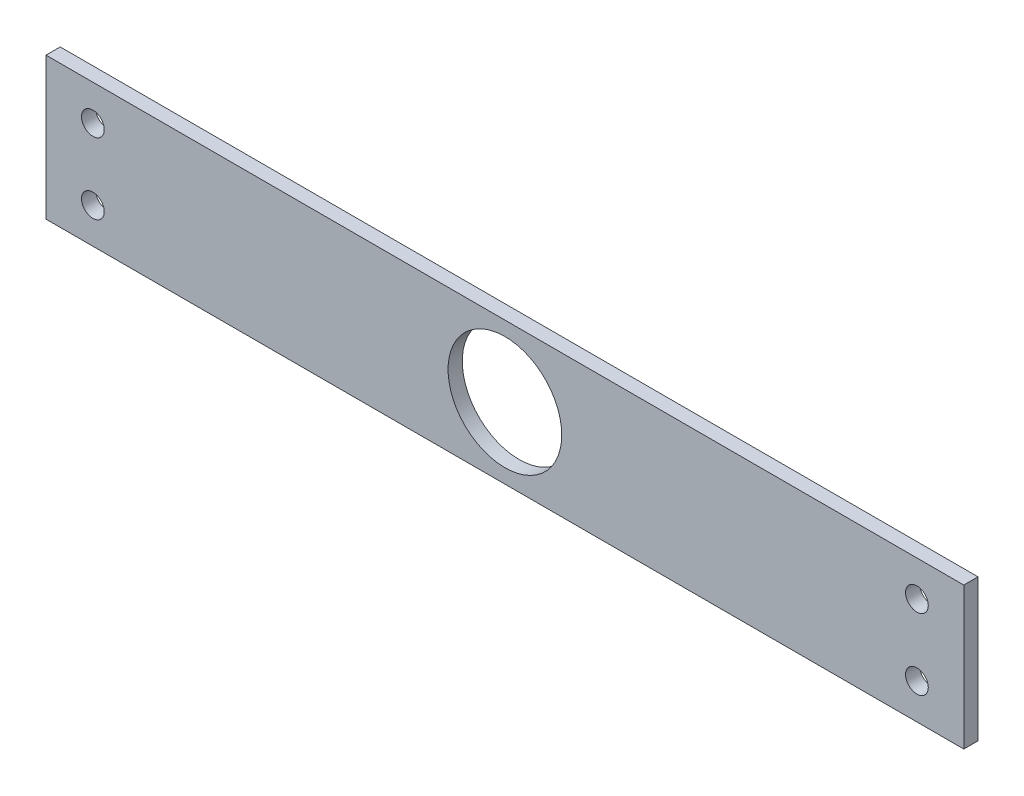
from build123d import *

# Parameters (mm, degrees)
ESQUISSE1_W        = 323
ESQUISSE1_H        = 50
ESQUISSE1_R        = 20
ESQUISSE1_R_2      = 4
BOSS_EXTRU_1_DEPTH = 5


with BuildPart() as part:
    # Esquisse1 → Boss.-Extru.1 (new body)
    with BuildSketch(Plane.XY):
        with Locations((161.5, 25)):
            Rectangle(ESQUISSE1_W, ESQUISSE1_H)
        with Locations((161.5, 25)):
            Circle(ESQUISSE1_R, mode=Mode.SUBTRACT)
        with Locations((16.5, 37.5)):
            Circle(ESQUISSE1_R_2, mode=Mode.SUBTRACT)
        with Locations((16.5, 12.5)):
            Circle(ESQUISSE1_R_2, mode=Mode.SUBTRACT)
        with Locations((306.5, 12.5)):
            Circle(ESQUISSE1_R_2, mode=Mode.SUBTRACT)
        with Locations((306.5, 37.5)):
            Circle(ESQUISSE1_R_2, mode=Mode.SUBTRACT)
    extrude(amount=BOSS_EXTRU_1_DEPTH)


solid = part.part
